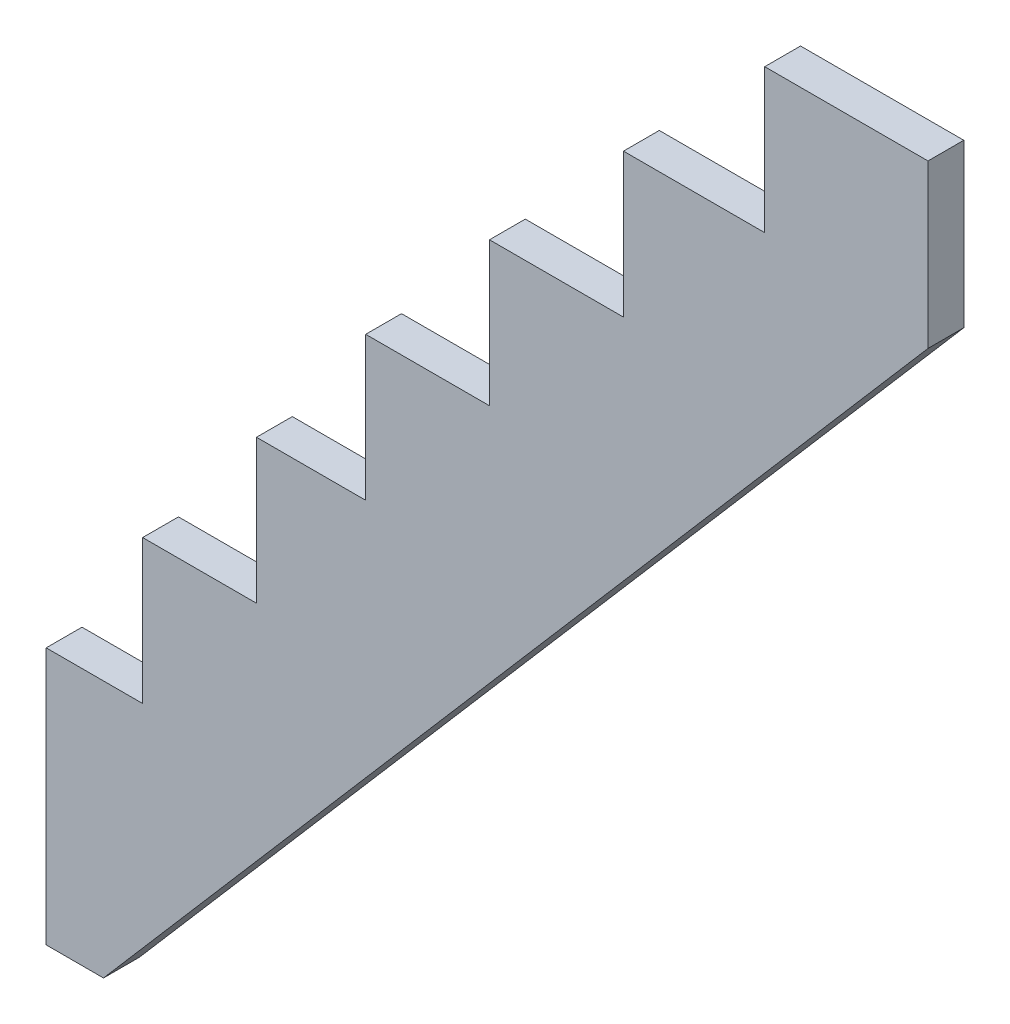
from build123d import *

# Parameters (mm, degrees)
EXTRUDE_1_DEPTH = 50


with BuildPart() as part:
    # Sketch 1 → Extrude 1 (new body)
    with BuildSketch(Plane.XY):
        Polygon((-415.807218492, -661.405142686), (-643.807218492, -661.405142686), (-643.807218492, -862.175142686), (-841.084162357, -862.175142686), (-841.084162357, -1062.945142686), (-1028.188672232, -1062.945142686), (-1028.188672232, -1263.715142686), (-1201.076427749, -1263.715142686), (-1201.076427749, -1464.485142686), (-1353.587328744, -1464.485142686), (-1353.587328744, -1665.255142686), (-1512.556669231, -1665.255142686), (-1512.556669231, -1866.025142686), (-1647.267975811, -1866.025142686), (-1647.267975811, -2225.338784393), (-1567.267975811, -2225.338784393), (-415.807218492, -888.177713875), align=None)
    extrude(amount=EXTRUDE_1_DEPTH)


solid = part.part
